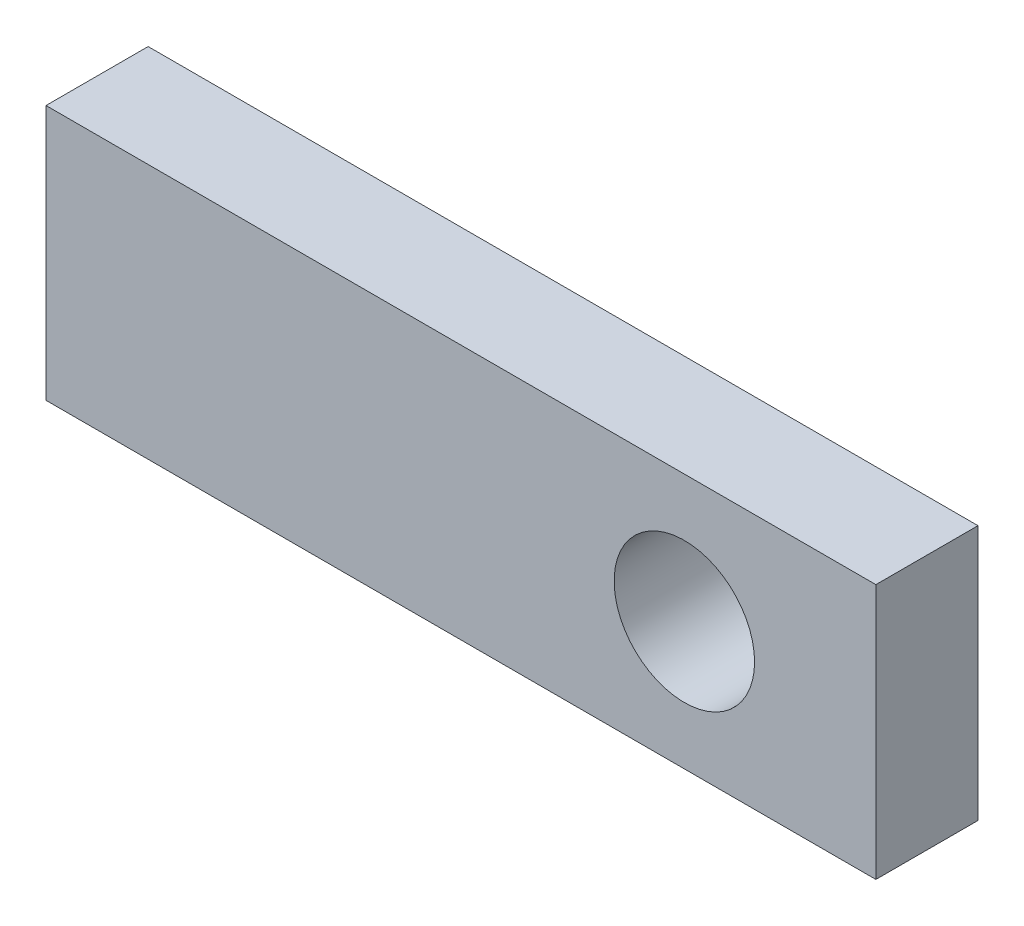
ISO-10303-21;
HEADER;
FILE_DESCRIPTION(('STEP AP214'),'2;1');
FILE_NAME('part.step','',(''),(''),'','','');
FILE_SCHEMA(('AUTOMOTIVE_DESIGN { 1 0 10303 214 1 1 1 1 }'));
ENDSEC;
DATA;
#1=APPLICATION_CONTEXT('core data for automotive mechanical design processes');
#2=APPLICATION_PROTOCOL_DEFINITION('international standard','automotive_design',2000,#1);
#3=PRODUCT_CONTEXT('',#1,'mechanical');
#4=PRODUCT('Part','Part','',(#3));
#5=PRODUCT_RELATED_PRODUCT_CATEGORY('part','',(#4));
#6=PRODUCT_DEFINITION_FORMATION('','',#4);
#7=PRODUCT_DEFINITION_CONTEXT('part definition',#1,'design');
#8=PRODUCT_DEFINITION('design','',#6,#7);
#9=PRODUCT_DEFINITION_SHAPE('','',#8);
#10=(LENGTH_UNIT() NAMED_UNIT(*) SI_UNIT(.MILLI.,.METRE.));
#11=(NAMED_UNIT(*) PLANE_ANGLE_UNIT() SI_UNIT($,.RADIAN.));
#12=(NAMED_UNIT(*) SI_UNIT($,.STERADIAN.) SOLID_ANGLE_UNIT());
#13=UNCERTAINTY_MEASURE_WITH_UNIT(LENGTH_MEASURE(1.E-05),#10,'distance_accuracy_value','');
#14=(GEOMETRIC_REPRESENTATION_CONTEXT(3) GLOBAL_UNCERTAINTY_ASSIGNED_CONTEXT((#13)) GLOBAL_UNIT_ASSIGNED_CONTEXT((#10,
#11,#12)) REPRESENTATION_CONTEXT('',''));
#15=CARTESIAN_POINT('',(0.,0.,0.));
#16=DIRECTION('',(0.,0.,1.));
#17=DIRECTION('',(1.,0.,0.));
#18=AXIS2_PLACEMENT_3D('',#15,#16,#17);
#19=CARTESIAN_POINT('',(0.,0.,8.));
#20=DIRECTION('',(1.,0.,0.));
#21=DIRECTION('',(0.,0.,-1.));
#22=AXIS2_PLACEMENT_3D('',#19,#20,#21);
#23=PLANE('',#22);
#24=DIRECTION('',(0.,-1.,0.));
#25=VECTOR('',#24,1.);
#26=CARTESIAN_POINT('',(0.,0.,0.));
#27=LINE('',#26,#25);
#28=CARTESIAN_POINT('',(0.,20.,0.));
#29=VERTEX_POINT('',#28);
#30=CARTESIAN_POINT('',(0.,0.,0.));
#31=VERTEX_POINT('',#30);
#32=EDGE_CURVE('E75',#29,#31,#27,.T.);
#33=ORIENTED_EDGE('',*,*,#32,.T.);
#34=DIRECTION('',(0.,0.,-1.));
#35=VECTOR('',#34,1.);
#36=CARTESIAN_POINT('',(0.,0.,8.));
#37=LINE('',#36,#35);
#38=CARTESIAN_POINT('',(0.,0.,8.));
#39=VERTEX_POINT('',#38);
#40=EDGE_CURVE('E11',#39,#31,#37,.T.);
#41=ORIENTED_EDGE('',*,*,#40,.F.);
#42=DIRECTION('',(0.,-1.,0.));
#43=VECTOR('',#42,1.);
#44=CARTESIAN_POINT('',(0.,0.,8.));
#45=LINE('',#44,#43);
#46=CARTESIAN_POINT('',(0.,20.,8.));
#47=VERTEX_POINT('',#46);
#48=EDGE_CURVE('E98',#47,#39,#45,.T.);
#49=ORIENTED_EDGE('',*,*,#48,.F.);
#50=DIRECTION('',(0.,0.,-1.));
#51=VECTOR('',#50,1.);
#52=CARTESIAN_POINT('',(0.,20.,8.));
#53=LINE('',#52,#51);
#54=EDGE_CURVE('E87',#47,#29,#53,.T.);
#55=ORIENTED_EDGE('',*,*,#54,.T.);
#56=EDGE_LOOP('',(#33,#41,#49,#55));
#57=FACE_BOUND('',#56,.T.);
#58=ADVANCED_FACE('F31',(#57),#23,.F.);
#59=CARTESIAN_POINT('',(0.,0.,8.));
#60=DIRECTION('',(0.,1.,0.));
#61=DIRECTION('',(0.,0.,1.));
#62=AXIS2_PLACEMENT_3D('',#59,#60,#61);
#63=PLANE('',#62);
#64=DIRECTION('',(1.,0.,0.));
#65=VECTOR('',#64,1.);
#66=CARTESIAN_POINT('',(0.,0.,0.));
#67=LINE('',#66,#65);
#68=CARTESIAN_POINT('',(65.,0.,0.));
#69=VERTEX_POINT('',#68);
#70=EDGE_CURVE('E71',#31,#69,#67,.T.);
#71=ORIENTED_EDGE('',*,*,#70,.T.);
#72=DIRECTION('',(0.,0.,-1.));
#73=VECTOR('',#72,1.);
#74=CARTESIAN_POINT('',(65.,0.,8.));
#75=LINE('',#74,#73);
#76=CARTESIAN_POINT('',(65.,0.,8.));
#77=VERTEX_POINT('',#76);
#78=EDGE_CURVE('E38',#77,#69,#75,.T.);
#79=ORIENTED_EDGE('',*,*,#78,.F.);
#80=DIRECTION('',(1.,0.,0.));
#81=VECTOR('',#80,1.);
#82=CARTESIAN_POINT('',(0.,0.,8.));
#83=LINE('',#82,#81);
#84=EDGE_CURVE('E83',#39,#77,#83,.T.);
#85=ORIENTED_EDGE('',*,*,#84,.F.);
#86=ORIENTED_EDGE('',*,*,#40,.T.);
#87=EDGE_LOOP('',(#71,#79,#85,#86));
#88=FACE_BOUND('',#87,.T.);
#89=ADVANCED_FACE('F82',(#88),#63,.F.);
#90=CARTESIAN_POINT('',(65.,0.,8.));
#91=DIRECTION('',(-1.,0.,0.));
#92=DIRECTION('',(0.,0.,1.));
#93=AXIS2_PLACEMENT_3D('',#90,#91,#92);
#94=PLANE('',#93);
#95=DIRECTION('',(0.,1.,0.));
#96=VECTOR('',#95,1.);
#97=CARTESIAN_POINT('',(65.,0.,0.));
#98=LINE('',#97,#96);
#99=CARTESIAN_POINT('',(65.,20.,0.));
#100=VERTEX_POINT('',#99);
#101=EDGE_CURVE('E76',#69,#100,#98,.T.);
#102=ORIENTED_EDGE('',*,*,#101,.T.);
#103=DIRECTION('',(0.,0.,-1.));
#104=VECTOR('',#103,1.);
#105=CARTESIAN_POINT('',(65.,20.,8.));
#106=LINE('',#105,#104);
#107=CARTESIAN_POINT('',(65.,20.,8.));
#108=VERTEX_POINT('',#107);
#109=EDGE_CURVE('E104',#108,#100,#106,.T.);
#110=ORIENTED_EDGE('',*,*,#109,.F.);
#111=DIRECTION('',(0.,1.,0.));
#112=VECTOR('',#111,1.);
#113=CARTESIAN_POINT('',(65.,0.,8.));
#114=LINE('',#113,#112);
#115=EDGE_CURVE('E50',#77,#108,#114,.T.);
#116=ORIENTED_EDGE('',*,*,#115,.F.);
#117=ORIENTED_EDGE('',*,*,#78,.T.);
#118=EDGE_LOOP('',(#102,#110,#116,#117));
#119=FACE_BOUND('',#118,.T.);
#120=ADVANCED_FACE('F107',(#119),#94,.F.);
#121=CARTESIAN_POINT('',(0.,20.,8.));
#122=DIRECTION('',(0.,-1.,0.));
#123=DIRECTION('',(0.,0.,-1.));
#124=AXIS2_PLACEMENT_3D('',#121,#122,#123);
#125=PLANE('',#124);
#126=DIRECTION('',(-1.,0.,0.));
#127=VECTOR('',#126,1.);
#128=CARTESIAN_POINT('',(0.,20.,0.));
#129=LINE('',#128,#127);
#130=EDGE_CURVE('E96',#100,#29,#129,.T.);
#131=ORIENTED_EDGE('',*,*,#130,.T.);
#132=ORIENTED_EDGE('',*,*,#54,.F.);
#133=DIRECTION('',(-1.,0.,0.));
#134=VECTOR('',#133,1.);
#135=CARTESIAN_POINT('',(0.,20.,8.));
#136=LINE('',#135,#134);
#137=EDGE_CURVE('E45',#108,#47,#136,.T.);
#138=ORIENTED_EDGE('',*,*,#137,.F.);
#139=ORIENTED_EDGE('',*,*,#109,.T.);
#140=EDGE_LOOP('',(#131,#132,#138,#139));
#141=FACE_BOUND('',#140,.T.);
#142=ADVANCED_FACE('F109',(#141),#125,.F.);
#143=CARTESIAN_POINT('',(0.,20.,8.));
#144=DIRECTION('',(0.,0.,-1.));
#145=DIRECTION('',(-1.,0.,0.));
#146=AXIS2_PLACEMENT_3D('',#143,#144,#145);
#147=PLANE('',#146);
#148=CARTESIAN_POINT('',(50.,10.,8.));
#149=DIRECTION('',(0.,0.,1.));
#150=DIRECTION('',(1.,0.,0.));
#151=AXIS2_PLACEMENT_3D('',#148,#149,#150);
#152=CIRCLE('',#151,5.5);
#153=CARTESIAN_POINT('',(55.5,10.,8.));
#154=VERTEX_POINT('',#153);
#155=EDGE_CURVE('E91',#154,#154,#152,.T.);
#156=ORIENTED_EDGE('',*,*,#155,.F.);
#157=EDGE_LOOP('',(#156));
#158=FACE_BOUND('',#157,.T.);
#159=ORIENTED_EDGE('',*,*,#48,.T.);
#160=ORIENTED_EDGE('',*,*,#84,.T.);
#161=ORIENTED_EDGE('',*,*,#115,.T.);
#162=ORIENTED_EDGE('',*,*,#137,.T.);
#163=EDGE_LOOP('',(#159,#160,#161,#162));
#164=FACE_BOUND('',#163,.T.);
#165=ADVANCED_FACE('F110',(#158,#164),#147,.F.);
#166=CARTESIAN_POINT('',(0.,20.,0.));
#167=DIRECTION('',(0.,0.,-1.));
#168=DIRECTION('',(-1.,0.,0.));
#169=AXIS2_PLACEMENT_3D('',#166,#167,#168);
#170=PLANE('',#169);
#171=CARTESIAN_POINT('',(50.,10.,0.));
#172=DIRECTION('',(0.,0.,1.));
#173=DIRECTION('',(1.,0.,0.));
#174=AXIS2_PLACEMENT_3D('',#171,#172,#173);
#175=CIRCLE('',#174,5.5);
#176=CARTESIAN_POINT('',(55.5,10.,0.));
#177=VERTEX_POINT('',#176);
#178=EDGE_CURVE('E88',#177,#177,#175,.T.);
#179=ORIENTED_EDGE('',*,*,#178,.T.);
#180=EDGE_LOOP('',(#179));
#181=FACE_BOUND('',#180,.T.);
#182=ORIENTED_EDGE('',*,*,#32,.F.);
#183=ORIENTED_EDGE('',*,*,#130,.F.);
#184=ORIENTED_EDGE('',*,*,#101,.F.);
#185=ORIENTED_EDGE('',*,*,#70,.F.);
#186=EDGE_LOOP('',(#182,#183,#184,#185));
#187=FACE_BOUND('',#186,.T.);
#188=ADVANCED_FACE('F72',(#181,#187),#170,.T.);
#189=CARTESIAN_POINT('',(50.,10.,0.));
#190=DIRECTION('',(0.,0.,1.));
#191=DIRECTION('',(1.,0.,0.));
#192=AXIS2_PLACEMENT_3D('',#189,#190,#191);
#193=CYLINDRICAL_SURFACE('',#192,5.5);
#194=ORIENTED_EDGE('',*,*,#178,.F.);
#195=EDGE_LOOP('',(#194));
#196=FACE_BOUND('',#195,.T.);
#197=ORIENTED_EDGE('',*,*,#155,.T.);
#198=EDGE_LOOP('',(#197));
#199=FACE_BOUND('',#198,.T.);
#200=ADVANCED_FACE('F118',(#196,#199),#193,.F.);
#201=CLOSED_SHELL('',(#58,#89,#120,#142,#165,#188,#200));
#202=MANIFOLD_SOLID_BREP('B2',#201);
#203=ADVANCED_BREP_SHAPE_REPRESENTATION('',(#18,#202),#14);
#204=SHAPE_DEFINITION_REPRESENTATION(#9,#203);
ENDSEC;
END-ISO-10303-21;
